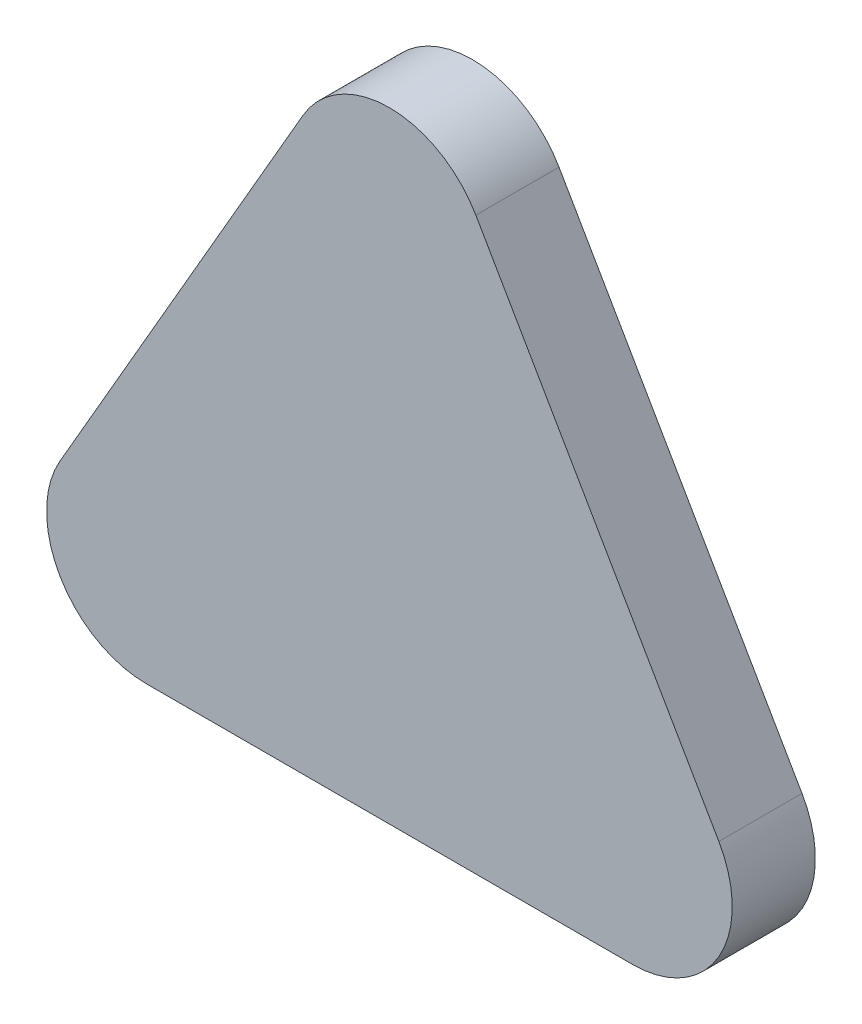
from build123d import *

# Parameters (mm, degrees)
EXTRUDE1_DEPTH = 6.35


with BuildPart() as part:
    # Sketch1 → Extrude1 (new body)
    with BuildSketch(Plane.XY):
        with BuildLine():
            Line((-18.551772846, 0), (18.551772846, 0))
            ThreePointArc((18.551772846, 0), (25.150886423, 3.81), (25.150886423, 11.43))
            Line((25.150886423, 11.43), (6.599113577, 43.56261314))
            ThreePointArc((6.599113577, 43.56261314), (0, 47.37261314), (-6.599113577, 43.56261314))
            Line((-6.599113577, 43.56261314), (-25.150886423, 11.43))
            ThreePointArc((-25.150886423, 11.43), (-25.150886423, 3.81), (-18.551772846, 0))
        make_face()
    extrude(amount=EXTRUDE1_DEPTH)


solid = part.part
